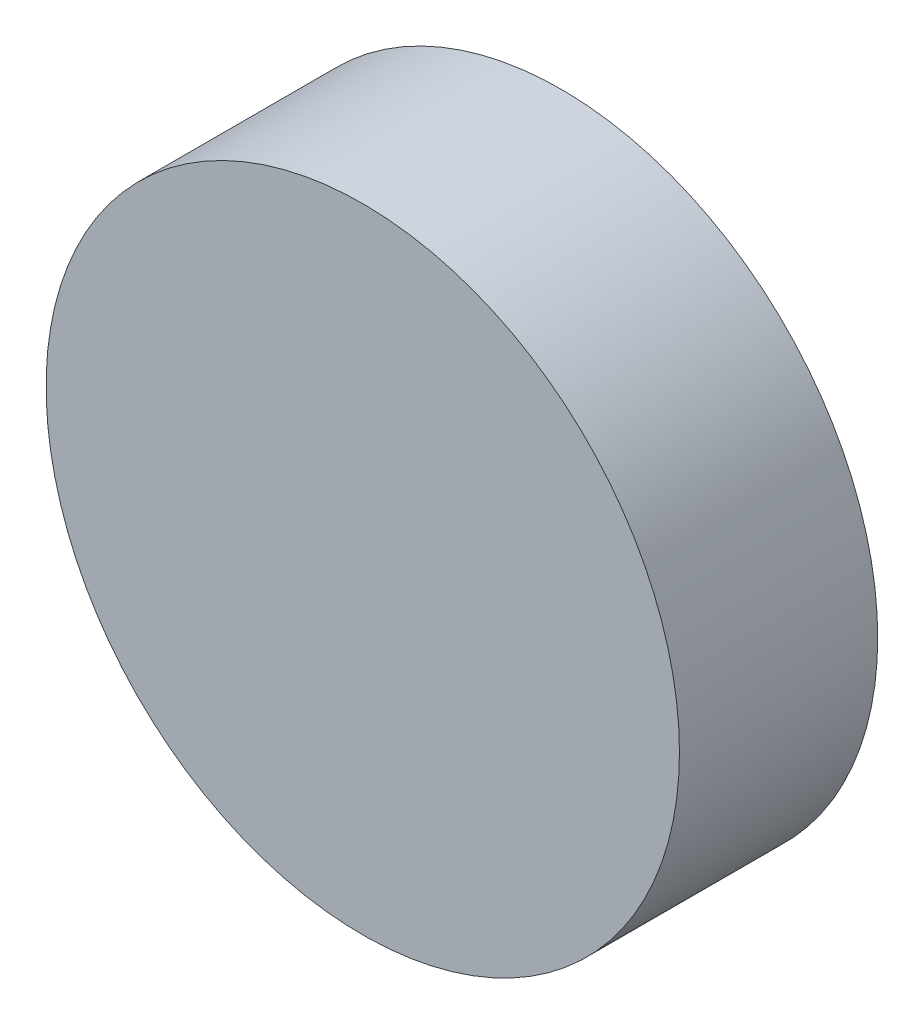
ISO-10303-21;
HEADER;
FILE_DESCRIPTION(('STEP AP214'),'2;1');
FILE_NAME('part.step','',(''),(''),'','','');
FILE_SCHEMA(('AUTOMOTIVE_DESIGN { 1 0 10303 214 1 1 1 1 }'));
ENDSEC;
DATA;
#1=APPLICATION_CONTEXT('core data for automotive mechanical design processes');
#2=APPLICATION_PROTOCOL_DEFINITION('international standard','automotive_design',2000,#1);
#3=PRODUCT_CONTEXT('',#1,'mechanical');
#4=PRODUCT('Part','Part','',(#3));
#5=PRODUCT_RELATED_PRODUCT_CATEGORY('part','',(#4));
#6=PRODUCT_DEFINITION_FORMATION('','',#4);
#7=PRODUCT_DEFINITION_CONTEXT('part definition',#1,'design');
#8=PRODUCT_DEFINITION('design','',#6,#7);
#9=PRODUCT_DEFINITION_SHAPE('','',#8);
#10=(LENGTH_UNIT() NAMED_UNIT(*) SI_UNIT(.MILLI.,.METRE.));
#11=(NAMED_UNIT(*) PLANE_ANGLE_UNIT() SI_UNIT($,.RADIAN.));
#12=(NAMED_UNIT(*) SI_UNIT($,.STERADIAN.) SOLID_ANGLE_UNIT());
#13=UNCERTAINTY_MEASURE_WITH_UNIT(LENGTH_MEASURE(1.E-05),#10,'distance_accuracy_value','');
#14=(GEOMETRIC_REPRESENTATION_CONTEXT(3) GLOBAL_UNCERTAINTY_ASSIGNED_CONTEXT((#13)) GLOBAL_UNIT_ASSIGNED_CONTEXT((#10,
#11,#12)) REPRESENTATION_CONTEXT('',''));
#15=CARTESIAN_POINT('',(0.,0.,0.));
#16=DIRECTION('',(0.,0.,1.));
#17=DIRECTION('',(1.,0.,0.));
#18=AXIS2_PLACEMENT_3D('',#15,#16,#17);
#19=CARTESIAN_POINT('',(0.,0.,0.));
#20=DIRECTION('',(0.,0.,1.));
#21=DIRECTION('',(1.,0.,0.));
#22=AXIS2_PLACEMENT_3D('',#19,#20,#21);
#23=PLANE('',#22);
#24=CARTESIAN_POINT('',(0.,0.,0.));
#25=DIRECTION('',(0.,0.,1.));
#26=DIRECTION('',(1.,0.,0.));
#27=AXIS2_PLACEMENT_3D('',#24,#25,#26);
#28=CIRCLE('',#27,73.025);
#29=CARTESIAN_POINT('',(73.025,0.,0.));
#30=VERTEX_POINT('',#29);
#31=EDGE_CURVE('E56',#30,#30,#28,.T.);
#32=ORIENTED_EDGE('',*,*,#31,.F.);
#33=EDGE_LOOP('',(#32));
#34=FACE_BOUND('',#33,.T.);
#35=CARTESIAN_POINT('',(0.,0.,0.));
#36=DIRECTION('',(0.,0.,1.));
#37=DIRECTION('',(1.,0.,0.));
#38=AXIS2_PLACEMENT_3D('',#35,#36,#37);
#39=CIRCLE('',#38,68.834);
#40=CARTESIAN_POINT('',(68.834,0.,0.));
#41=VERTEX_POINT('',#40);
#42=EDGE_CURVE('E10',#41,#41,#39,.F.);
#43=ORIENTED_EDGE('',*,*,#42,.F.);
#44=EDGE_LOOP('',(#43));
#45=FACE_BOUND('',#44,.T.);
#46=ADVANCED_FACE('F35',(#34,#45),#23,.F.);
#47=ORIENTED_EDGE('',*,*,#42,.T.);
#48=EDGE_LOOP('',(#47));
#49=FACE_BOUND('',#48,.T.);
#50=CARTESIAN_POINT('',(0.,0.,0.));
#51=DIRECTION('',(0.,0.,1.));
#52=DIRECTION('',(1.,0.,0.));
#53=AXIS2_PLACEMENT_3D('',#50,#51,#52);
#54=CIRCLE('',#53,60.325);
#55=CARTESIAN_POINT('',(60.325,0.,0.));
#56=VERTEX_POINT('',#55);
#57=EDGE_CURVE('E43',#56,#56,#54,.F.);
#58=ORIENTED_EDGE('',*,*,#57,.F.);
#59=EDGE_LOOP('',(#58));
#60=FACE_BOUND('',#59,.T.);
#61=ADVANCED_FACE('F65',(#49,#60),#23,.F.);
#62=CARTESIAN_POINT('',(0.,0.,45.72));
#63=DIRECTION('',(0.,0.,-1.));
#64=DIRECTION('',(-1.,0.,0.));
#65=AXIS2_PLACEMENT_3D('',#62,#63,#64);
#66=CYLINDRICAL_SURFACE('',#65,73.025);
#67=CARTESIAN_POINT('',(0.,0.,45.72));
#68=DIRECTION('',(0.,0.,1.));
#69=DIRECTION('',(1.,0.,0.));
#70=AXIS2_PLACEMENT_3D('',#67,#68,#69);
#71=CIRCLE('',#70,73.025);
#72=CARTESIAN_POINT('',(73.025,0.,45.72));
#73=VERTEX_POINT('',#72);
#74=EDGE_CURVE('E50',#73,#73,#71,.T.);
#75=ORIENTED_EDGE('',*,*,#74,.F.);
#76=EDGE_LOOP('',(#75));
#77=FACE_BOUND('',#76,.T.);
#78=ORIENTED_EDGE('',*,*,#31,.T.);
#79=EDGE_LOOP('',(#78));
#80=FACE_BOUND('',#79,.T.);
#81=ADVANCED_FACE('F37',(#77,#80),#66,.T.);
#82=CARTESIAN_POINT('',(0.,0.,45.72));
#83=DIRECTION('',(0.,0.,1.));
#84=DIRECTION('',(1.,0.,0.));
#85=AXIS2_PLACEMENT_3D('',#82,#83,#84);
#86=PLANE('',#85);
#87=ORIENTED_EDGE('',*,*,#74,.T.);
#88=EDGE_LOOP('',(#87));
#89=FACE_BOUND('',#88,.T.);
#90=ADVANCED_FACE('F72',(#89),#86,.T.);
#91=ORIENTED_EDGE('',*,*,#57,.T.);
#92=EDGE_LOOP('',(#91));
#93=FACE_BOUND('',#92,.T.);
#94=ADVANCED_FACE('F66',(#93),#23,.F.);
#95=CLOSED_SHELL('',(#46,#61,#81,#90,#94));
#96=MANIFOLD_SOLID_BREP('B2',#95);
#97=ADVANCED_BREP_SHAPE_REPRESENTATION('',(#18,#96),#14);
#98=SHAPE_DEFINITION_REPRESENTATION(#9,#97);
ENDSEC;
END-ISO-10303-21;
